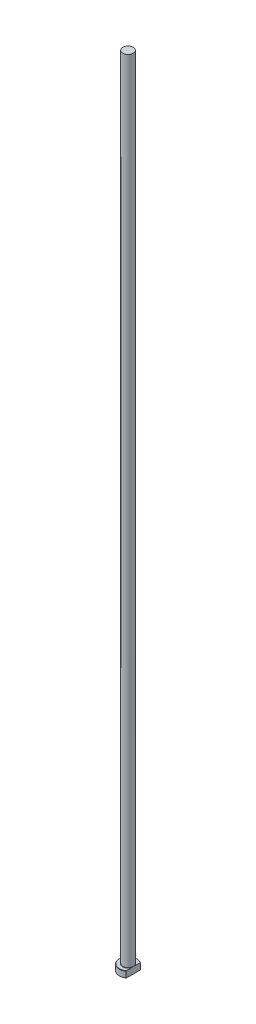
ISO-10303-21;
HEADER;
FILE_DESCRIPTION(('STEP AP214'),'2;1');
FILE_NAME('part.step','',(''),(''),'','','');
FILE_SCHEMA(('AUTOMOTIVE_DESIGN { 1 0 10303 214 1 1 1 1 }'));
ENDSEC;
DATA;
#1=APPLICATION_CONTEXT('core data for automotive mechanical design processes');
#2=APPLICATION_PROTOCOL_DEFINITION('international standard','automotive_design',2000,#1);
#3=PRODUCT_CONTEXT('',#1,'mechanical');
#4=PRODUCT('Part','Part','',(#3));
#5=PRODUCT_RELATED_PRODUCT_CATEGORY('part','',(#4));
#6=PRODUCT_DEFINITION_FORMATION('','',#4);
#7=PRODUCT_DEFINITION_CONTEXT('part definition',#1,'design');
#8=PRODUCT_DEFINITION('design','',#6,#7);
#9=PRODUCT_DEFINITION_SHAPE('','',#8);
#10=(LENGTH_UNIT() NAMED_UNIT(*) SI_UNIT(.MILLI.,.METRE.));
#11=(NAMED_UNIT(*) PLANE_ANGLE_UNIT() SI_UNIT($,.RADIAN.));
#12=(NAMED_UNIT(*) SI_UNIT($,.STERADIAN.) SOLID_ANGLE_UNIT());
#13=UNCERTAINTY_MEASURE_WITH_UNIT(LENGTH_MEASURE(1.E-05),#10,'distance_accuracy_value','');
#14=(GEOMETRIC_REPRESENTATION_CONTEXT(3) GLOBAL_UNCERTAINTY_ASSIGNED_CONTEXT((#13)) GLOBAL_UNIT_ASSIGNED_CONTEXT((#10,
#11,#12)) REPRESENTATION_CONTEXT('',''));
#15=CARTESIAN_POINT('',(0.,0.,0.));
#16=DIRECTION('',(0.,0.,1.));
#17=DIRECTION('',(1.,0.,0.));
#18=AXIS2_PLACEMENT_3D('',#15,#16,#17);
#19=CARTESIAN_POINT('',(0.,0.,0.));
#20=DIRECTION('',(0.,-1.,0.));
#21=DIRECTION('',(0.,0.,-1.));
#22=AXIS2_PLACEMENT_3D('',#19,#20,#21);
#23=PLANE('',#22);
#24=CARTESIAN_POINT('',(0.,0.,0.));
#25=DIRECTION('',(0.,-1.,0.));
#26=DIRECTION('',(0.,0.,-1.));
#27=AXIS2_PLACEMENT_3D('',#24,#25,#26);
#28=CIRCLE('',#27,6.80000000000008);
#29=CARTESIAN_POINT('',(4.09999999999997,0.,5.42494239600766));
#30=VERTEX_POINT('',#29);
#31=CARTESIAN_POINT('',(4.09999999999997,0.,-5.42494239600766));
#32=VERTEX_POINT('',#31);
#33=EDGE_CURVE('E98',#30,#32,#28,.T.);
#34=ORIENTED_EDGE('',*,*,#33,.T.);
#35=DIRECTION('',(0.,0.,1.));
#36=VECTOR('',#35,1.);
#37=CARTESIAN_POINT('',(4.09999999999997,0.,-5.6736231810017));
#38=LINE('',#37,#36);
#39=EDGE_CURVE('E83',#32,#30,#38,.T.);
#40=ORIENTED_EDGE('',*,*,#39,.T.);
#41=EDGE_LOOP('',(#34,#40));
#42=FACE_BOUND('',#41,.T.);
#43=ADVANCED_FACE('F32',(#42),#23,.T.);
#44=CARTESIAN_POINT('',(0.,259.958771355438,0.));
#45=DIRECTION('',(0.,1.,0.));
#46=DIRECTION('',(0.,0.,1.));
#47=AXIS2_PLACEMENT_3D('',#44,#45,#46);
#48=CYLINDRICAL_SURFACE('',#47,6.99999999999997);
#49=CARTESIAN_POINT('',(0.,4.79999999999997,0.));
#50=DIRECTION('',(0.,1.,0.));
#51=DIRECTION('',(0.,0.,1.));
#52=AXIS2_PLACEMENT_3D('',#49,#50,#51);
#53=CIRCLE('',#52,6.99999999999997);
#54=CARTESIAN_POINT('',(4.09999999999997,4.79999999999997,5.6736231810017));
#55=VERTEX_POINT('',#54);
#56=CARTESIAN_POINT('',(4.09999999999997,4.79999999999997,-5.6736231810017));
#57=VERTEX_POINT('',#56);
#58=EDGE_CURVE('E104',#55,#57,#53,.F.);
#59=ORIENTED_EDGE('',*,*,#58,.T.);
#60=DIRECTION('',(0.,-1.,0.));
#61=VECTOR('',#60,1.);
#62=CARTESIAN_POINT('',(4.09999999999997,630.,-5.6736231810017));
#63=LINE('',#62,#61);
#64=CARTESIAN_POINT('',(4.09999999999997,0.199999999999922,-5.6736231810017));
#65=VERTEX_POINT('',#64);
#66=EDGE_CURVE('E183',#57,#65,#63,.T.);
#67=ORIENTED_EDGE('',*,*,#66,.T.);
#68=CARTESIAN_POINT('',(0.,0.199999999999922,0.));
#69=DIRECTION('',(0.,-1.,0.));
#70=DIRECTION('',(0.,0.,-1.));
#71=AXIS2_PLACEMENT_3D('',#68,#69,#70);
#72=CIRCLE('',#71,6.99999999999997);
#73=CARTESIAN_POINT('',(4.09999999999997,0.199999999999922,5.6736231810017));
#74=VERTEX_POINT('',#73);
#75=EDGE_CURVE('E100',#65,#74,#72,.F.);
#76=ORIENTED_EDGE('',*,*,#75,.T.);
#77=DIRECTION('',(0.,-1.,0.));
#78=VECTOR('',#77,1.);
#79=CARTESIAN_POINT('',(4.09999999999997,630.,5.6736231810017));
#80=LINE('',#79,#78);
#81=EDGE_CURVE('E93',#55,#74,#80,.T.);
#82=ORIENTED_EDGE('',*,*,#81,.F.);
#83=EDGE_LOOP('',(#59,#67,#76,#82));
#84=FACE_BOUND('',#83,.T.);
#85=ADVANCED_FACE('F158',(#84),#48,.T.);
#86=CARTESIAN_POINT('',(-6.99999999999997,5.,0.));
#87=DIRECTION('',(0.,1.,0.));
#88=DIRECTION('',(0.,0.,1.));
#89=AXIS2_PLACEMENT_3D('',#86,#87,#88);
#90=PLANE('',#89);
#91=CARTESIAN_POINT('',(0.,5.,0.));
#92=DIRECTION('',(0.,1.,0.));
#93=DIRECTION('',(0.,0.,1.));
#94=AXIS2_PLACEMENT_3D('',#91,#92,#93);
#95=CIRCLE('',#94,6.79999999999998);
#96=CARTESIAN_POINT('',(4.09999999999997,5.,-5.42494239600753));
#97=VERTEX_POINT('',#96);
#98=CARTESIAN_POINT('',(4.09999999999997,5.,5.42494239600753));
#99=VERTEX_POINT('',#98);
#100=EDGE_CURVE('E178',#97,#99,#95,.T.);
#101=ORIENTED_EDGE('',*,*,#100,.T.);
#102=DIRECTION('',(0.,0.,-1.));
#103=VECTOR('',#102,1.);
#104=CARTESIAN_POINT('',(4.09999999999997,5.,0.));
#105=LINE('',#104,#103);
#106=CARTESIAN_POINT('',(4.09999999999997,4.99999999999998,1.29614813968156));
#107=VERTEX_POINT('',#106);
#108=EDGE_CURVE('E57',#99,#107,#105,.T.);
#109=ORIENTED_EDGE('',*,*,#108,.T.);
#110=CARTESIAN_POINT('',(0.,5.,0.));
#111=DIRECTION('',(0.,1.,0.));
#112=DIRECTION('',(0.,0.,1.));
#113=AXIS2_PLACEMENT_3D('',#110,#111,#112);
#114=CIRCLE('',#113,4.29999999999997);
#115=CARTESIAN_POINT('',(4.09999999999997,4.99999999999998,-1.29614813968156));
#116=VERTEX_POINT('',#115);
#117=EDGE_CURVE('E107',#107,#116,#114,.F.);
#118=ORIENTED_EDGE('',*,*,#117,.T.);
#119=EDGE_CURVE('E136',#116,#97,#105,.T.);
#120=ORIENTED_EDGE('',*,*,#119,.T.);
#121=EDGE_LOOP('',(#101,#109,#118,#120));
#122=FACE_BOUND('',#121,.T.);
#123=ADVANCED_FACE('F147',(#122),#90,.T.);
#124=CARTESIAN_POINT('',(0.,5.,0.));
#125=DIRECTION('',(0.,-1.,0.));
#126=DIRECTION('',(0.,0.,-1.));
#127=AXIS2_PLACEMENT_3D('',#124,#125,#126);
#128=CONICAL_SURFACE('',#127,6.79999999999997,0.785398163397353);
#129=ORIENTED_EDGE('',*,*,#58,.F.);
#130=CARTESIAN_POINT('',(4.09999999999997,-1.33929192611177,12.483228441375));
#131=CARTESIAN_POINT('',(4.09999999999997,-1.13691180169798,12.2702073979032));
#132=CARTESIAN_POINT('',(4.09999999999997,-0.934791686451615,12.0569390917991));
#133=CARTESIAN_POINT('',(4.09999999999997,-0.531169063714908,11.6298164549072));
#134=CARTESIAN_POINT('',(4.09999999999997,-0.329666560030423,11.4159621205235));
#135=CARTESIAN_POINT('',(4.09999999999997,0.273965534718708,10.7731725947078));
#136=CARTESIAN_POINT('',(4.09999999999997,0.675017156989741,10.3432236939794));
#137=CARTESIAN_POINT('',(4.09999999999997,1.47875431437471,9.47345436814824));
#138=CARTESIAN_POINT('',(4.09999999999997,1.88138218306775,9.03358046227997));
#139=CARTESIAN_POINT('',(4.09999999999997,2.48056970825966,8.36963259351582));
#140=CARTESIAN_POINT('',(4.09999999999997,2.6794685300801,8.147670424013));
#141=CARTESIAN_POINT('',(4.09999999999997,3.07530374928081,7.70200314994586));
#142=CARTESIAN_POINT('',(4.09999999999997,3.2722401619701,7.47829805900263));
#143=CARTESIAN_POINT('',(4.09999999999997,3.62803580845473,7.06959504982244));
#144=CARTESIAN_POINT('',(4.09999999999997,3.78730687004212,6.88495594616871));
#145=CARTESIAN_POINT('',(4.09999999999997,4.10378434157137,6.51391771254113));
#146=CARTESIAN_POINT('',(4.09999999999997,4.26099077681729,6.3275186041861));
#147=CARTESIAN_POINT('',(4.09999999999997,4.57299335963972,5.95235210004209));
#148=CARTESIAN_POINT('',(4.09999999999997,4.72778657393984,5.76358225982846));
#149=CARTESIAN_POINT('',(4.09999999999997,5.03405385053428,5.38337519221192));
#150=CARTESIAN_POINT('',(4.09999999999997,5.18552806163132,5.19193808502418));
#151=CARTESIAN_POINT('',(4.09999999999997,5.48381165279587,4.80616050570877));
#152=CARTESIAN_POINT('',(4.09999999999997,5.63063104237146,4.61182780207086));
#153=CARTESIAN_POINT('',(4.09999999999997,5.9185732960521,4.218895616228));
#154=CARTESIAN_POINT('',(4.09999999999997,6.05969490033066,4.02029520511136));
#155=CARTESIAN_POINT('',(4.09999999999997,6.33384612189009,3.61807653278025));
#156=CARTESIAN_POINT('',(4.09999999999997,6.46688994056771,3.41446801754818));
#157=CARTESIAN_POINT('',(4.09999999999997,6.721962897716,3.00051329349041));
#158=CARTESIAN_POINT('',(4.09999999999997,6.84399822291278,2.79017096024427));
#159=CARTESIAN_POINT('',(4.09999999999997,7.04294800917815,2.4161362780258));
#160=CARTESIAN_POINT('',(4.09999999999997,7.12340018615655,2.2543409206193));
#161=CARTESIAN_POINT('',(4.09999999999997,7.2727881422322,1.92538984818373));
#162=CARTESIAN_POINT('',(4.09999999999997,7.34172134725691,1.75823294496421));
#163=CARTESIAN_POINT('',(4.09999999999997,7.46395062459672,1.41984946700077));
#164=CARTESIAN_POINT('',(4.09999999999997,7.51737823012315,1.24867129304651));
#165=CARTESIAN_POINT('',(4.09999999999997,7.60539482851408,0.901532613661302));
#166=CARTESIAN_POINT('',(4.09999999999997,7.63999996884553,0.725576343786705));
#167=CARTESIAN_POINT('',(4.09999999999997,7.6803635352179,0.42108610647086));
#168=CARTESIAN_POINT('',(4.09999999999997,7.6915205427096,0.293260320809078));
#169=CARTESIAN_POINT('',(4.09999999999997,7.70182627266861,0.0371280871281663));
#170=CARTESIAN_POINT('',(4.09999999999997,7.70097696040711,-0.0911782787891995));
#171=CARTESIAN_POINT('',(4.09999999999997,7.68730446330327,-0.347367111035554));
#172=CARTESIAN_POINT('',(4.09999999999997,7.6744601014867,-0.475248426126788));
#173=CARTESIAN_POINT('',(4.09999999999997,7.63752967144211,-0.729373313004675));
#174=CARTESIAN_POINT('',(4.09999999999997,7.61344101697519,-0.855616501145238));
#175=CARTESIAN_POINT('',(4.09999999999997,7.54404317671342,-1.15392625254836));
#176=CARTESIAN_POINT('',(4.09999999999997,7.49413451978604,-1.32492035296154));
#177=CARTESIAN_POINT('',(4.09999999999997,7.37892989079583,-1.66161692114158));
#178=CARTESIAN_POINT('',(4.09999999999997,7.31362410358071,-1.82731593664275));
#179=CARTESIAN_POINT('',(4.09999999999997,7.17079959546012,-2.15435858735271));
#180=CARTESIAN_POINT('',(4.09999999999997,7.0932172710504,-2.31567410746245));
#181=CARTESIAN_POINT('',(4.09999999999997,6.97004119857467,-2.5540384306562));
#182=CARTESIAN_POINT('',(4.09999999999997,6.92785402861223,-2.63288278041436));
#183=CARTESIAN_POINT('',(4.09999999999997,6.84148468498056,-2.78946923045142));
#184=CARTESIAN_POINT('',(4.09999999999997,6.79730258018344,-2.86721136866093));
#185=CARTESIAN_POINT('',(4.09999999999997,6.65934609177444,-3.10372248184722));
#186=CARTESIAN_POINT('',(4.09999999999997,6.56274427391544,-3.26084376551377));
#187=CARTESIAN_POINT('',(4.09999999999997,6.3638913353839,-3.5714843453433));
#188=CARTESIAN_POINT('',(4.09999999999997,6.26163896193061,-3.72500283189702));
#189=CARTESIAN_POINT('',(4.09999999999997,6.05267831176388,-4.02913378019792));
#190=CARTESIAN_POINT('',(4.09999999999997,5.94596678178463,-4.17974399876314));
#191=CARTESIAN_POINT('',(4.09999999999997,5.72908222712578,-4.47845767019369));
#192=CARTESIAN_POINT('',(4.09999999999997,5.61890895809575,-4.6265609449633));
#193=CARTESIAN_POINT('',(4.09999999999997,5.39553225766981,-4.92101937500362));
#194=CARTESIAN_POINT('',(4.09999999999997,5.28232219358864,-5.0673694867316));
#195=CARTESIAN_POINT('',(4.09999999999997,5.05364560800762,-5.35829836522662));
#196=CARTESIAN_POINT('',(4.09999999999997,4.93817902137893,-5.50287708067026));
#197=CARTESIAN_POINT('',(4.09999999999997,4.589004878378,-5.93440610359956));
#198=CARTESIAN_POINT('',(4.09999999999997,4.35254037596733,-6.21912657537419));
#199=CARTESIAN_POINT('',(4.09999999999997,3.99368021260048,-6.64336157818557));
#200=CARTESIAN_POINT('',(4.09999999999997,3.87318866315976,-6.78450136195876));
#201=CARTESIAN_POINT('',(4.09999999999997,3.63111125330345,-7.06582575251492));
#202=CARTESIAN_POINT('',(4.09999999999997,3.50952546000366,-7.2060104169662));
#203=CARTESIAN_POINT('',(4.09999999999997,3.14334067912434,-7.6253764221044));
#204=CARTESIAN_POINT('',(4.09999999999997,2.89734299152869,-7.90333600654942));
#205=CARTESIAN_POINT('',(4.09999999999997,2.40293836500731,-8.45636150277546));
#206=CARTESIAN_POINT('',(4.09999999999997,2.15453550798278,-8.73143107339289));
#207=CARTESIAN_POINT('',(4.09999999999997,1.65560568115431,-9.27963529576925));
#208=CARTESIAN_POINT('',(4.09999999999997,1.40507871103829,-9.55276994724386));
#209=CARTESIAN_POINT('',(4.09999999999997,0.947239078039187,-10.0488717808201));
#210=CARTESIAN_POINT('',(4.09999999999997,0.740197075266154,-10.2720890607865));
#211=CARTESIAN_POINT('',(4.09999999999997,0.32511671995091,-10.7177199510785));
#212=CARTESIAN_POINT('',(4.09999999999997,0.117078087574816,-10.9401333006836));
#213=CARTESIAN_POINT('',(4.09999999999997,-0.298674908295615,-11.383046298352));
#214=CARTESIAN_POINT('',(4.09999999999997,-0.506385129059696,-11.6035498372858));
#215=CARTESIAN_POINT('',(4.09999999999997,-0.922403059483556,-12.0438652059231));
#216=CARTESIAN_POINT('',(4.09999999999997,-1.13071056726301,-12.2636772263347));
#217=CARTESIAN_POINT('',(4.09999999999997,-1.33929192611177,-12.483228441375));
#218=B_SPLINE_CURVE_WITH_KNOTS('',3,(#130,#131,#132,#133,#134,#135,#136,#137,#138,#139,#140,
#141,#142,#143,#144,#145,#146,#147,#148,#149,#150,#151,#152,#153,#154,#155,#156,#157,#158,#159,
#160,#161,#162,#163,#164,#165,#166,#167,#168,#169,#170,#171,#172,#173,#174,#175,#176,#177,#178,
#179,#180,#181,#182,#183,#184,#185,#186,#187,#188,#189,#190,#191,#192,#193,#194,#195,#196,#197,
#198,#199,#200,#201,#202,#203,#204,#205,#206,#207,#208,#209,#210,#211,#212,#213,#214,#215,#216,
#217),.UNSPECIFIED.,.F.,.F.,(4,2,2,2,2,2,2,2,2,2,2,2,2,2,2,2,2,2,2,2,2,2,2,2,2,2,2,2,2,2,2,2,2,
2,2,2,2,2,2,2,2,2,2,4),(0.,0.88148793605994,1.76298129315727,3.52684938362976,5.31576438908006,
6.20987642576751,7.10398148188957,7.83549529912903,8.56700014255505,9.29933394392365,
10.0316348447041,10.7622363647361,11.4929985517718,12.2224363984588,12.9514617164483,
13.4932089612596,14.035077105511,14.5722044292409,15.10887023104,15.4932846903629,
15.8776362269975,16.2626676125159,16.6477876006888,17.181194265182,17.7149418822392,
18.2515512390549,18.5197937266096,18.7880269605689,19.3411787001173,19.8944535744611,
20.4481394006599,21.0018643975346,21.5569172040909,22.1119860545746,23.2222096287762,
23.7789368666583,24.3356301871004,25.4491497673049,26.5610293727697,27.6729091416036,
28.5862688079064,29.4999020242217,30.4086844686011,31.3171893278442),.UNSPECIFIED.);
#219=EDGE_CURVE('E135',#55,#99,#218,.T.);
#220=ORIENTED_EDGE('',*,*,#219,.T.);
#221=ORIENTED_EDGE('',*,*,#100,.F.);
#222=EDGE_CURVE('E127',#97,#57,#218,.T.);
#223=ORIENTED_EDGE('',*,*,#222,.T.);
#224=EDGE_LOOP('',(#129,#220,#221,#223));
#225=FACE_BOUND('',#224,.T.);
#226=ADVANCED_FACE('F143',(#225),#128,.T.);
#227=CARTESIAN_POINT('',(0.,0.199999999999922,0.));
#228=DIRECTION('',(0.,1.,0.));
#229=DIRECTION('',(0.,0.,1.));
#230=AXIS2_PLACEMENT_3D('',#227,#228,#229);
#231=CONICAL_SURFACE('',#230,6.99999999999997,0.785398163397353);
#232=ORIENTED_EDGE('',*,*,#75,.F.);
#233=CARTESIAN_POINT('',(4.09999999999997,6.33929192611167,-12.483228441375));
#234=CARTESIAN_POINT('',(4.09999999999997,6.13691180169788,-12.2702073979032));
#235=CARTESIAN_POINT('',(4.09999999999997,5.93479168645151,-12.0569390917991));
#236=CARTESIAN_POINT('',(4.09999999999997,5.5311690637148,-11.6298164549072));
#237=CARTESIAN_POINT('',(4.09999999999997,5.32966656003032,-11.4159621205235));
#238=CARTESIAN_POINT('',(4.09999999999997,4.72603446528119,-10.7731725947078));
#239=CARTESIAN_POINT('',(4.09999999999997,4.32498284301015,-10.3432236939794));
#240=CARTESIAN_POINT('',(4.09999999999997,3.52124568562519,-9.47345436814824));
#241=CARTESIAN_POINT('',(4.09999999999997,3.11861781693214,-9.03358046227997));
#242=CARTESIAN_POINT('',(4.09999999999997,2.51943029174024,-8.36963259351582));
#243=CARTESIAN_POINT('',(4.09999999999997,2.32053146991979,-8.147670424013));
#244=CARTESIAN_POINT('',(4.09999999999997,1.92469625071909,-7.70200314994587));
#245=CARTESIAN_POINT('',(4.09999999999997,1.72775983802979,-7.47829805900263));
#246=CARTESIAN_POINT('',(4.09999999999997,1.37196419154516,-7.06959504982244));
#247=CARTESIAN_POINT('',(4.09999999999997,1.21269312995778,-6.88495594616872));
#248=CARTESIAN_POINT('',(4.09999999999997,0.896215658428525,-6.51391771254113));
#249=CARTESIAN_POINT('',(4.09999999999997,0.739009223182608,-6.3275186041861));
#250=CARTESIAN_POINT('',(4.09999999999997,0.427006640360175,-5.9523521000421));
#251=CARTESIAN_POINT('',(4.09999999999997,0.272213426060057,-5.76358225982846));
#252=CARTESIAN_POINT('',(4.09999999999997,-0.0340538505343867,-5.38337519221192));
#253=CARTESIAN_POINT('',(4.09999999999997,-0.185528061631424,-5.19193808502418));
#254=CARTESIAN_POINT('',(4.09999999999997,-0.483811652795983,-4.80616050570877));
#255=CARTESIAN_POINT('',(4.09999999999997,-0.630631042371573,-4.61182780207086));
#256=CARTESIAN_POINT('',(4.09999999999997,-0.918573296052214,-4.218895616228));
#257=CARTESIAN_POINT('',(4.09999999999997,-1.05969490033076,-4.02029520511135));
#258=CARTESIAN_POINT('',(4.09999999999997,-1.3338461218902,-3.61807653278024));
#259=CARTESIAN_POINT('',(4.09999999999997,-1.46688994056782,-3.41446801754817));
#260=CARTESIAN_POINT('',(4.09999999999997,-1.72196289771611,-3.0005132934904));
#261=CARTESIAN_POINT('',(4.09999999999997,-1.84399822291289,-2.79017096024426));
#262=CARTESIAN_POINT('',(4.09999999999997,-2.04294800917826,-2.4161362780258));
#263=CARTESIAN_POINT('',(4.09999999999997,-2.12340018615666,-2.25434092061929));
#264=CARTESIAN_POINT('',(4.09999999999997,-2.2727881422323,-1.92538984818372));
#265=CARTESIAN_POINT('',(4.09999999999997,-2.34172134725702,-1.75823294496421));
#266=CARTESIAN_POINT('',(4.09999999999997,-2.46395062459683,-1.41984946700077));
#267=CARTESIAN_POINT('',(4.09999999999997,-2.51737823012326,-1.2486712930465));
#268=CARTESIAN_POINT('',(4.09999999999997,-2.60539482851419,-0.901532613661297));
#269=CARTESIAN_POINT('',(4.09999999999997,-2.63999996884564,-0.725576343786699));
#270=CARTESIAN_POINT('',(4.09999999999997,-2.68036353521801,-0.421086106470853));
#271=CARTESIAN_POINT('',(4.09999999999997,-2.6915205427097,-0.293260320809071));
#272=CARTESIAN_POINT('',(4.09999999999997,-2.70182627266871,-0.0371280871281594));
#273=CARTESIAN_POINT('',(4.09999999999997,-2.70097696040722,0.0911782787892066));
#274=CARTESIAN_POINT('',(4.09999999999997,-2.68730446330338,0.347367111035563));
#275=CARTESIAN_POINT('',(4.09999999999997,-2.67446010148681,0.475248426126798));
#276=CARTESIAN_POINT('',(4.09999999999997,-2.63752967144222,0.729373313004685));
#277=CARTESIAN_POINT('',(4.09999999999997,-2.6134410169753,0.855616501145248));
#278=CARTESIAN_POINT('',(4.09999999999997,-2.54404317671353,1.15392625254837));
#279=CARTESIAN_POINT('',(4.09999999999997,-2.49413451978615,1.32492035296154));
#280=CARTESIAN_POINT('',(4.09999999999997,-2.37892989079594,1.66161692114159));
#281=CARTESIAN_POINT('',(4.09999999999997,-2.31362410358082,1.82731593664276));
#282=CARTESIAN_POINT('',(4.09999999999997,-2.17079959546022,2.15435858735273));
#283=CARTESIAN_POINT('',(4.09999999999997,-2.0932172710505,2.31567410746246));
#284=CARTESIAN_POINT('',(4.09999999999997,-1.97004119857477,2.55403843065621));
#285=CARTESIAN_POINT('',(4.09999999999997,-1.92785402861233,2.63288278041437));
#286=CARTESIAN_POINT('',(4.09999999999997,-1.84148468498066,2.78946923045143));
#287=CARTESIAN_POINT('',(4.09999999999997,-1.79730258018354,2.86721136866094));
#288=CARTESIAN_POINT('',(4.09999999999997,-1.65934609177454,3.10372248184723));
#289=CARTESIAN_POINT('',(4.09999999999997,-1.56274427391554,3.26084376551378));
#290=CARTESIAN_POINT('',(4.09999999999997,-1.36389133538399,3.57148434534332));
#291=CARTESIAN_POINT('',(4.09999999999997,-1.26163896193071,3.72500283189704));
#292=CARTESIAN_POINT('',(4.09999999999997,-1.05267831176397,4.02913378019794));
#293=CARTESIAN_POINT('',(4.09999999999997,-0.945966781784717,4.17974399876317));
#294=CARTESIAN_POINT('',(4.09999999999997,-0.729082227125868,4.47845767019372));
#295=CARTESIAN_POINT('',(4.09999999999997,-0.618908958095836,4.62656094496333));
#296=CARTESIAN_POINT('',(4.09999999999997,-0.395532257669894,4.92101937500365));
#297=CARTESIAN_POINT('',(4.09999999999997,-0.282322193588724,5.06736948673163));
#298=CARTESIAN_POINT('',(4.09999999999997,-0.0536456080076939,5.35829836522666));
#299=CARTESIAN_POINT('',(4.09999999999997,0.0618209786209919,5.5028770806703));
#300=CARTESIAN_POINT('',(4.09999999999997,0.410995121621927,5.9344061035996));
#301=CARTESIAN_POINT('',(4.09999999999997,0.647459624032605,6.21912657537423));
#302=CARTESIAN_POINT('',(4.09999999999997,1.00631978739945,6.64336157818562));
#303=CARTESIAN_POINT('',(4.09999999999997,1.12681133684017,6.7845013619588));
#304=CARTESIAN_POINT('',(4.09999999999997,1.36888874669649,7.06582575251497));
#305=CARTESIAN_POINT('',(4.09999999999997,1.49047453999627,7.20601041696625));
#306=CARTESIAN_POINT('',(4.09999999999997,1.8566593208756,7.62537642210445));
#307=CARTESIAN_POINT('',(4.09999999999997,2.10265700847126,7.90333600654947));
#308=CARTESIAN_POINT('',(4.09999999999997,2.59706163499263,8.45636150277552));
#309=CARTESIAN_POINT('',(4.09999999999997,2.84546449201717,8.73143107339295));
#310=CARTESIAN_POINT('',(4.09999999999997,3.34439431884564,9.27963529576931));
#311=CARTESIAN_POINT('',(4.09999999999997,3.59492128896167,9.55276994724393));
#312=CARTESIAN_POINT('',(4.09999999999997,4.05276092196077,10.0488717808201));
#313=CARTESIAN_POINT('',(4.09999999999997,4.25980292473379,10.2720890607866));
#314=CARTESIAN_POINT('',(4.09999999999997,4.67488328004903,10.7177199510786));
#315=CARTESIAN_POINT('',(4.09999999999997,4.88292191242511,10.9401333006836));
#316=CARTESIAN_POINT('',(4.09999999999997,5.29867490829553,11.383046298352));
#317=CARTESIAN_POINT('',(4.09999999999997,5.50638512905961,11.6035498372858));
#318=CARTESIAN_POINT('',(4.09999999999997,5.92240305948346,12.0438652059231));
#319=CARTESIAN_POINT('',(4.09999999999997,6.13071056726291,12.2636772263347));
#320=CARTESIAN_POINT('',(4.09999999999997,6.33929192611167,12.483228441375));
#321=B_SPLINE_CURVE_WITH_KNOTS('',3,(#233,#234,#235,#236,#237,#238,#239,#240,#241,#242,#243,
#244,#245,#246,#247,#248,#249,#250,#251,#252,#253,#254,#255,#256,#257,#258,#259,#260,#261,#262,
#263,#264,#265,#266,#267,#268,#269,#270,#271,#272,#273,#274,#275,#276,#277,#278,#279,#280,#281,
#282,#283,#284,#285,#286,#287,#288,#289,#290,#291,#292,#293,#294,#295,#296,#297,#298,#299,#300,
#301,#302,#303,#304,#305,#306,#307,#308,#309,#310,#311,#312,#313,#314,#315,#316,#317,#318,#319,
#320),.UNSPECIFIED.,.F.,.F.,(4,2,2,2,2,2,2,2,2,2,2,2,2,2,2,2,2,2,2,2,2,2,2,2,2,2,2,2,2,2,2,2,2,
2,2,2,2,2,2,2,2,2,2,4),(0.,0.881487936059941,1.76298129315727,3.52684938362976,5.31576438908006,
6.20987642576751,7.10398148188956,7.83549529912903,8.56700014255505,9.29933394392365,
10.0316348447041,10.7622363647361,11.4929985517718,12.2224363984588,12.9514617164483,
13.4932089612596,14.035077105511,14.572204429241,15.10887023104,15.4932846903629,
15.8776362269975,16.2626676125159,16.6477876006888,17.181194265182,17.7149418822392,
18.2515512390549,18.5197937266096,18.7880269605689,19.3411787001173,19.8944535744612,
20.4481394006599,21.0018643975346,21.556917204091,22.1119860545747,23.2222096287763,
23.7789368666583,24.3356301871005,25.449149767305,26.5610293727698,27.6729091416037,
28.5862688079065,29.4999020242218,30.4086844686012,31.3171893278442),.UNSPECIFIED.);
#322=EDGE_CURVE('E86',#65,#32,#321,.T.);
#323=ORIENTED_EDGE('',*,*,#322,.T.);
#324=ORIENTED_EDGE('',*,*,#33,.F.);
#325=EDGE_CURVE('E89',#30,#74,#321,.T.);
#326=ORIENTED_EDGE('',*,*,#325,.T.);
#327=EDGE_LOOP('',(#232,#323,#324,#326));
#328=FACE_BOUND('',#327,.T.);
#329=ADVANCED_FACE('F97',(#328),#231,.T.);
#330=CARTESIAN_POINT('',(0.,5.19999999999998,0.));
#331=DIRECTION('',(0.,1.,0.));
#332=DIRECTION('',(0.,0.,1.));
#333=AXIS2_PLACEMENT_3D('',#330,#331,#332);
#334=TOROIDAL_SURFACE('',#333,4.29999999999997,0.2);
#335=CARTESIAN_POINT('',(4.09999999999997,5.19999999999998,0.));
#336=CARTESIAN_POINT('',(4.09999999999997,5.20000051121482,8.48177579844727E-11));
#337=CARTESIAN_POINT('',(4.09999999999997,5.2000010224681,-2.37341874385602E-07));
#338=CARTESIAN_POINT('',(4.09999999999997,5.20000197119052,-8.69991321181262E-07));
#339=CARTESIAN_POINT('',(4.09999999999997,5.20000238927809,-1.28223494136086E-06));
#340=CARTESIAN_POINT('',(4.09999999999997,5.20000327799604,-2.27653388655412E-06));
#341=CARTESIAN_POINT('',(4.09999999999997,5.20000373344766,-2.87471299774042E-06));
#342=CARTESIAN_POINT('',(4.09999999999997,5.20000453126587,-4.09830357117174E-06));
#343=CARTESIAN_POINT('',(4.09999999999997,5.20000487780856,-4.72126748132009E-06));
#344=CARTESIAN_POINT('',(4.09999999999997,5.20000620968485,-7.19543436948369E-06));
#345=CARTESIAN_POINT('',(4.09999999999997,5.20000713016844,-9.08507628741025E-06));
#346=CARTESIAN_POINT('',(4.09999999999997,5.20000860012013,-1.27786167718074E-05));
#347=CARTESIAN_POINT('',(4.09999999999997,5.2000091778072,-1.45716794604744E-05));
#348=CARTESIAN_POINT('',(4.09999999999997,5.20001167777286,-2.23278313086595E-05));
#349=CARTESIAN_POINT('',(4.09999999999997,5.20001360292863,-2.82919348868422E-05));
#350=CARTESIAN_POINT('',(4.09999999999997,5.20001636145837,-3.94393207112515E-05));
#351=CARTESIAN_POINT('',(4.09999999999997,5.20001732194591,-4.459065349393E-05));
#352=CARTESIAN_POINT('',(4.09999999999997,5.20002443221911,-8.33481274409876E-05));
#353=CARTESIAN_POINT('',(4.09999999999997,5.20002995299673,-0.000117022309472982));
#354=CARTESIAN_POINT('',(4.09999999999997,5.20005411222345,-0.000250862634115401));
#355=CARTESIAN_POINT('',(4.09999999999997,5.20007702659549,-0.000350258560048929));
#356=CARTESIAN_POINT('',(4.09999999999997,5.20016686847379,-0.000745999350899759));
#357=CARTESIAN_POINT('',(4.09999999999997,5.20023113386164,-0.00104273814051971));
#358=CARTESIAN_POINT('',(4.09999999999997,5.20048975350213,-0.00222871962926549));
#359=CARTESIAN_POINT('',(4.09999999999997,5.20068752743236,-0.00311743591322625));
#360=CARTESIAN_POINT('',(4.09999999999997,5.20151360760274,-0.00683863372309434));
#361=CARTESIAN_POINT('',(4.09999999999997,5.20213761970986,-0.00967177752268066));
#362=CARTESIAN_POINT('',(4.09999999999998,5.21060513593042,-0.0481053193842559));
#363=CARTESIAN_POINT('',(4.09999999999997,5.21847514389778,-0.0837019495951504));
#364=CARTESIAN_POINT('',(4.09999999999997,5.23497753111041,-0.15888321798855));
#365=CARTESIAN_POINT('',(4.09999999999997,5.24359721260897,-0.198470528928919));
#366=CARTESIAN_POINT('',(4.09999999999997,5.25810552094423,-0.266014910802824));
#367=CARTESIAN_POINT('',(4.09999999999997,5.26405008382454,-0.293959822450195));
#368=CARTESIAN_POINT('',(4.09999999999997,5.27562355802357,-0.34912552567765));
#369=CARTESIAN_POINT('',(4.09999999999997,5.28125665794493,-0.376345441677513));
#370=CARTESIAN_POINT('',(4.09999999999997,5.29943979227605,-0.46575599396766));
#371=CARTESIAN_POINT('',(4.09999999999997,5.31159607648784,-0.528028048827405));
#372=CARTESIAN_POINT('',(4.09999999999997,5.3345183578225,-0.653452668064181));
#373=CARTESIAN_POINT('',(4.09999999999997,5.34526982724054,-0.716607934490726));
#374=CARTESIAN_POINT('',(4.09999999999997,5.36549989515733,-0.849208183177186));
#375=CARTESIAN_POINT('',(4.09999999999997,5.37476398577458,-0.918686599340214));
#376=CARTESIAN_POINT('',(4.09999999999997,5.38955225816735,-1.05786044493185));
#377=CARTESIAN_POINT('',(4.09999999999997,5.39508786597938,-1.12755454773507));
#378=CARTESIAN_POINT('',(4.09999999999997,5.3992964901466,-1.23112590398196));
#379=CARTESIAN_POINT('',(4.09999999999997,5.40003705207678,-1.26491756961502));
#380=CARTESIAN_POINT('',(4.09999999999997,5.39995996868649,-1.33249559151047));
#381=CARTESIAN_POINT('',(4.09999999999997,5.39914270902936,-1.36628194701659));
#382=CARTESIAN_POINT('',(4.09999999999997,5.39557880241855,-1.43339843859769));
#383=CARTESIAN_POINT('',(4.09999999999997,5.39285312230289,-1.46672955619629));
#384=CARTESIAN_POINT('',(4.09999999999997,5.3849220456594,-1.53304911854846));
#385=CARTESIAN_POINT('',(4.09999999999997,5.37972044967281,-1.56603800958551));
#386=CARTESIAN_POINT('',(4.09999999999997,5.36576321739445,-1.63210333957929));
#387=CARTESIAN_POINT('',(4.09999999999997,5.35693238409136,-1.66516593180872));
#388=CARTESIAN_POINT('',(4.09999999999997,5.33956496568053,-1.71313701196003));
#389=CARTESIAN_POINT('',(4.09999999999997,5.33312382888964,-1.72879572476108));
#390=CARTESIAN_POINT('',(4.09999999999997,5.31841020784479,-1.75921181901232));
#391=CARTESIAN_POINT('',(4.09999999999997,5.31014484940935,-1.77397243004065));
#392=CARTESIAN_POINT('',(4.09999999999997,5.29597609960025,-1.79459137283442));
#393=CARTESIAN_POINT('',(4.09999999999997,5.29105059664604,-1.80111732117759));
#394=CARTESIAN_POINT('',(4.09999999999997,5.28047159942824,-1.81356806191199));
#395=CARTESIAN_POINT('',(4.09999999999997,5.27481806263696,-1.81949281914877));
#396=CARTESIAN_POINT('',(4.09999999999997,5.26378662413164,-1.82942177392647));
#397=CARTESIAN_POINT('',(4.09999999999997,5.25854825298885,-1.83357893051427));
#398=CARTESIAN_POINT('',(4.09999999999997,5.24747881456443,-1.8410175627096));
#399=CARTESIAN_POINT('',(4.09999999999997,5.24164898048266,-1.84430081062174));
#400=CARTESIAN_POINT('',(4.09999999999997,5.23103019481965,-1.84897077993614));
#401=CARTESIAN_POINT('',(4.09999999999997,5.22636142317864,-1.85062832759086));
#402=CARTESIAN_POINT('',(4.09999999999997,5.21681344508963,-1.85314556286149));
#403=CARTESIAN_POINT('',(4.09999999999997,5.21193447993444,-1.85400614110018));
#404=CARTESIAN_POINT('',(4.09999999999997,5.2020790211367,-1.8548454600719));
#405=CARTESIAN_POINT('',(4.09999999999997,5.19710220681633,-1.85482052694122));
#406=CARTESIAN_POINT('',(4.09999999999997,5.18723254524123,-1.85388227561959));
#407=CARTESIAN_POINT('',(4.09999999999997,5.18233974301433,-1.8529684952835));
#408=CARTESIAN_POINT('',(4.09999999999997,5.17301169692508,-1.85041011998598));
#409=CARTESIAN_POINT('',(4.09999999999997,5.16856577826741,-1.84880345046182));
#410=CARTESIAN_POINT('',(4.09999999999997,5.15994310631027,-1.84499014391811));
#411=CARTESIAN_POINT('',(4.09999999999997,5.15576643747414,-1.84278331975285));
#412=CARTESIAN_POINT('',(4.09999999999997,5.1448604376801,-1.83616140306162));
#413=CARTESIAN_POINT('',(4.09999999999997,5.13841060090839,-1.8312871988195));
#414=CARTESIAN_POINT('',(4.09999999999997,5.12632402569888,-1.82061430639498));
#415=CARTESIAN_POINT('',(4.09999999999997,5.12069027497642,-1.81481237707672));
#416=CARTESIAN_POINT('',(4.09999999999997,5.10569835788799,-1.79748307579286));
#417=CARTESIAN_POINT('',(4.09999999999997,5.0971810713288,-1.78523612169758));
#418=CARTESIAN_POINT('',(4.09999999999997,5.08190874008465,-1.759730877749));
#419=CARTESIAN_POINT('',(4.09999999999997,5.07515617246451,-1.74647119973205));
#420=CARTESIAN_POINT('',(4.09999999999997,5.06057670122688,-1.71404296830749));
#421=CARTESIAN_POINT('',(4.09999999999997,5.05336936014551,-1.69459894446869));
#422=CARTESIAN_POINT('',(4.09999999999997,5.04078670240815,-1.65511361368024));
#423=CARTESIAN_POINT('',(4.09999999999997,5.03541518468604,-1.63507116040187));
#424=CARTESIAN_POINT('',(4.09999999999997,5.02602669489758,-1.59438056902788));
#425=CARTESIAN_POINT('',(4.09999999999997,5.02202979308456,-1.57372787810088));
#426=CARTESIAN_POINT('',(4.09999999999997,5.01520764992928,-1.53226128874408));
#427=CARTESIAN_POINT('',(4.09999999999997,5.01238102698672,-1.51144761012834));
#428=CARTESIAN_POINT('',(4.09999999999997,5.00618826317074,-1.45642510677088));
#429=CARTESIAN_POINT('',(4.09999999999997,5.00362476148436,-1.42212636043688));
#430=CARTESIAN_POINT('',(4.09999999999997,5.00045800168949,-1.35343324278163));
#431=CARTESIAN_POINT('',(4.09999999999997,4.99985588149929,-1.31903882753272));
#432=CARTESIAN_POINT('',(4.09999999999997,5.00037893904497,-1.21560964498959));
#433=CARTESIAN_POINT('',(4.09999999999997,5.00385566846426,-1.14658832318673));
#434=CARTESIAN_POINT('',(4.09999999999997,5.01464295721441,-1.01357004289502));
#435=CARTESIAN_POINT('',(4.09999999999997,5.02167983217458,-0.949547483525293));
#436=CARTESIAN_POINT('',(4.09999999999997,5.03833051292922,-0.822416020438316));
#437=CARTESIAN_POINT('',(4.09999999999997,5.04792112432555,-0.759304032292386));
#438=CARTESIAN_POINT('',(4.09999999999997,5.06649836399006,-0.648156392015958));
#439=CARTESIAN_POINT('',(4.09999999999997,5.07509963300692,-0.60005440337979));
#440=CARTESIAN_POINT('',(4.09999999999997,5.09336865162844,-0.5027171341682));
#441=CARTESIAN_POINT('',(4.09999999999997,5.10305882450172,-0.45348607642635));
#442=CARTESIAN_POINT('',(4.09999999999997,5.12010265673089,-0.369650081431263));
#443=CARTESIAN_POINT('',(4.09999999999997,5.1273025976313,-0.335013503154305));
#444=CARTESIAN_POINT('',(4.09999999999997,5.14184386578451,-0.26617579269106));
#445=CARTESIAN_POINT('',(4.09999999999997,5.14918270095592,-0.231974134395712));
#446=CARTESIAN_POINT('',(4.09999999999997,5.16314314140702,-0.167541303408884));
#447=CARTESIAN_POINT('',(4.09999999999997,5.16974991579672,-0.137306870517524));
#448=CARTESIAN_POINT('',(4.09999999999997,5.18332308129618,-0.0755506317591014));
#449=CARTESIAN_POINT('',(4.09999999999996,5.19029270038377,-0.0440294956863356));
#450=CARTESIAN_POINT('',(4.09999999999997,5.19786353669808,-0.00966658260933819));
#451=CARTESIAN_POINT('',(4.09999999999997,5.19848867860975,-0.00682823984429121));
#452=CARTESIAN_POINT('',(4.09999999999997,5.19931502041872,-0.00310588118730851));
#453=CARTESIAN_POINT('',(4.09999999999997,5.19951189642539,-0.00222119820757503));
#454=CARTESIAN_POINT('',(4.09999999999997,5.19976942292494,-0.00104022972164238));
#455=CARTESIAN_POINT('',(4.09999999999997,5.19983347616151,-0.000744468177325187));
#456=CARTESIAN_POINT('',(4.09999999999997,5.19992306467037,-0.000349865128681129));
#457=CARTESIAN_POINT('',(4.09999999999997,5.1999459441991,-0.000250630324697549));
#458=CARTESIAN_POINT('',(4.09999999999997,5.19997007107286,-0.000116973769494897));
#459=CARTESIAN_POINT('',(4.09999999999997,5.19997558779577,-8.33211280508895E-05));
#460=CARTESIAN_POINT('',(4.09999999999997,5.19998268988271,-4.45857715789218E-05));
#461=CARTESIAN_POINT('',(4.09999999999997,5.19998364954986,-3.94355404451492E-05));
#462=CARTESIAN_POINT('',(4.09999999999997,5.19998640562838,-2.82904942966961E-05));
#463=CARTESIAN_POINT('',(4.09999999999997,5.19998832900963,-2.23275713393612E-05));
#464=CARTESIAN_POINT('',(4.09999999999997,5.19999082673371,-1.45726655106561E-05));
#465=CARTESIAN_POINT('',(4.09999999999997,5.19999140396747,-1.27796833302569E-05));
#466=CARTESIAN_POINT('',(4.09999999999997,5.19999287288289,-9.08623741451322E-06));
#467=CARTESIAN_POINT('',(4.09999999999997,5.19999379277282,-7.19659802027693E-06));
#468=CARTESIAN_POINT('',(4.09999999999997,5.19999512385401,-4.72235852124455E-06));
#469=CARTESIAN_POINT('',(4.09999999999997,5.1999954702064,-4.0993503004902E-06));
#470=CARTESIAN_POINT('',(4.09999999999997,5.19999626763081,-2.87563677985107E-06));
#471=CARTESIAN_POINT('',(4.09999999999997,5.19999672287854,-2.2773772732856E-06));
#472=CARTESIAN_POINT('',(4.09999999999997,5.19999761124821,-1.28289389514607E-06));
#473=CARTESIAN_POINT('',(4.09999999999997,5.19999802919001,-8.70554048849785E-07));
#474=CARTESIAN_POINT('',(4.09999999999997,5.19999897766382,-2.3765555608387E-07));
#475=CARTESIAN_POINT('',(4.09999999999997,5.19999948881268,-8.48131903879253E-11));
#476=CARTESIAN_POINT('',(4.09999999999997,5.19999999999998,0.));
#477=B_SPLINE_CURVE_WITH_KNOTS('',3,(#335,#336,#337,#338,#339,#340,#341,#342,#343,#344,#345,
#346,#347,#348,#349,#350,#351,#352,#353,#354,#355,#356,#357,#358,#359,#360,#361,#362,#363,#364,
#365,#366,#367,#368,#369,#370,#371,#372,#373,#374,#375,#376,#377,#378,#379,#380,#381,#382,#383,
#384,#385,#386,#387,#388,#389,#390,#391,#392,#393,#394,#395,#396,#397,#398,#399,#400,#401,#402,
#403,#404,#405,#406,#407,#408,#409,#410,#411,#412,#413,#414,#415,#416,#417,#418,#419,#420,#421,
#422,#423,#424,#425,#426,#427,#428,#429,#430,#431,#432,#433,#434,#435,#436,#437,#438,#439,#440,
#441,#442,#443,#444,#445,#446,#447,#448,#449,#450,#451,#452,#453,#454,#455,#456,#457,#458,#459,
#460,#461,#462,#463,#464,#465,#466,#467,#468,#469,#470,#471,#472,#473,#474,#475,#476),
.UNSPECIFIED.,.T.,.F.,(4,2,2,2,2,2,2,2,2,2,2,2,2,2,2,2,2,2,2,2,2,2,2,2,2,2,2,2,2,2,2,2,2,2,2,2,
2,2,2,2,2,2,2,2,2,2,2,2,2,2,2,2,2,2,2,2,2,2,2,2,2,2,2,2,2,2,2,2,2,2,4),(0.,1.56077961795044E-06,
3.3330233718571E-06,5.57220089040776E-06,7.71031786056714E-06,1.39959462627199E-05,
1.96420817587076E-05,3.84177478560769E-05,5.41207073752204E-05,0.000156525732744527,
0.000462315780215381,0.00137340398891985,0.00410448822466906,0.0128079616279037,
0.122174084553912,0.243719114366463,0.329429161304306,0.41281904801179,0.603149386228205,
0.795314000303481,1.0055338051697,1.21510641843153,1.31647802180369,1.41782453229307,
1.51807472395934,1.61817152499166,1.72045618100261,1.77118252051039,1.82171411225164,
1.84620451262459,1.87069634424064,1.89069743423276,1.91065764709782,1.92546132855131,
1.94024844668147,1.9550969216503,1.96995312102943,1.98408278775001,1.99821686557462,
2.02232905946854,2.04652741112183,2.09102796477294,2.13559065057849,2.19765435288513,
2.25984571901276,2.32290998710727,2.38589958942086,2.489000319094,2.59216085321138,
2.79925959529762,2.99242441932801,3.18389136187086,3.33047882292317,3.48099951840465,
3.58712985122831,3.69206963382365,3.78491369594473,3.88175875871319,3.89047819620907,
3.89319688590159,3.89410497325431,3.89441026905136,3.8945126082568,3.89452830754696,
3.8945470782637,3.89455272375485,3.89455900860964,3.89456114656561,3.89456338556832,
3.8945651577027,3.89456671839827),.UNSPECIFIED.);
#478=CARTESIAN_POINT('',(4.09999999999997,5.19999999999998,0.));
#479=VERTEX_POINT('',#478);
#480=EDGE_CURVE('E11',#116,#479,#477,.T.);
#481=ORIENTED_EDGE('',*,*,#480,.F.);
#482=ORIENTED_EDGE('',*,*,#117,.F.);
#483=CARTESIAN_POINT('',(4.09999999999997,5.19999999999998,0.));
#484=CARTESIAN_POINT('',(4.09999999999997,5.19999948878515,-8.48181322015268E-11));
#485=CARTESIAN_POINT('',(4.09999999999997,5.19999897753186,2.37341874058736E-07));
#486=CARTESIAN_POINT('',(4.09999999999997,5.19999802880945,8.69991321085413E-07));
#487=CARTESIAN_POINT('',(4.09999999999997,5.19999761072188,1.28223494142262E-06));
#488=CARTESIAN_POINT('',(4.09999999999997,5.19999672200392,2.27653388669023E-06));
#489=CARTESIAN_POINT('',(4.09999999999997,5.1999962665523,2.874712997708E-06));
#490=CARTESIAN_POINT('',(4.09999999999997,5.19999546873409,4.0983035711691E-06));
#491=CARTESIAN_POINT('',(4.09999999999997,5.1999951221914,4.72126748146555E-06));
#492=CARTESIAN_POINT('',(4.09999999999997,5.19999379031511,7.19543437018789E-06));
#493=CARTESIAN_POINT('',(4.09999999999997,5.19999286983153,9.0850762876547E-06));
#494=CARTESIAN_POINT('',(4.09999999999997,5.19999139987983,1.27786167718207E-05));
#495=CARTESIAN_POINT('',(4.09999999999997,5.19999082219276,1.45716794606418E-05));
#496=CARTESIAN_POINT('',(4.09999999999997,5.1999883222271,2.2327831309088E-05));
#497=CARTESIAN_POINT('',(4.09999999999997,5.19998639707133,2.82919348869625E-05));
#498=CARTESIAN_POINT('',(4.09999999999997,5.19998363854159,3.94393207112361E-05));
#499=CARTESIAN_POINT('',(4.09999999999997,5.19998267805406,4.45906534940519E-05));
#500=CARTESIAN_POINT('',(4.09999999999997,5.19997556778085,8.33481274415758E-05));
#501=CARTESIAN_POINT('',(4.09999999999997,5.19997004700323,0.000117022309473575));
#502=CARTESIAN_POINT('',(4.09999999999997,5.19994588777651,0.000250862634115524));
#503=CARTESIAN_POINT('',(4.09999999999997,5.19992297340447,0.000350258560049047));
#504=CARTESIAN_POINT('',(4.09999999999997,5.19983313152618,0.000745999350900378));
#505=CARTESIAN_POINT('',(4.09999999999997,5.19976886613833,0.00104273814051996));
#506=CARTESIAN_POINT('',(4.09999999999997,5.19951024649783,0.00222871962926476));
#507=CARTESIAN_POINT('',(4.09999999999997,5.1993124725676,0.00311743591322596));
#508=CARTESIAN_POINT('',(4.09999999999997,5.19848639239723,0.00683863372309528));
#509=CARTESIAN_POINT('',(4.09999999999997,5.19786238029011,0.0096717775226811));
#510=CARTESIAN_POINT('',(4.09999999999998,5.18939486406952,0.0481053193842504));
#511=CARTESIAN_POINT('',(4.09999999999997,5.18152485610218,0.0837019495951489));
#512=CARTESIAN_POINT('',(4.09999999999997,5.16502246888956,0.158883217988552));
#513=CARTESIAN_POINT('',(4.09999999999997,5.156402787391,0.19847052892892));
#514=CARTESIAN_POINT('',(4.09999999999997,5.14189447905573,0.266014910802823));
#515=CARTESIAN_POINT('',(4.09999999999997,5.13594991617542,0.293959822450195));
#516=CARTESIAN_POINT('',(4.09999999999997,5.12437644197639,0.34912552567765));
#517=CARTESIAN_POINT('',(4.09999999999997,5.11874334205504,0.376345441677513));
#518=CARTESIAN_POINT('',(4.09999999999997,5.10056020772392,0.46575599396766));
#519=CARTESIAN_POINT('',(4.09999999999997,5.08840392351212,0.528028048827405));
#520=CARTESIAN_POINT('',(4.09999999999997,5.06548164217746,0.65345266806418));
#521=CARTESIAN_POINT('',(4.09999999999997,5.05473017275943,0.716607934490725));
#522=CARTESIAN_POINT('',(4.09999999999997,5.03450010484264,0.849208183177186));
#523=CARTESIAN_POINT('',(4.09999999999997,5.02523601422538,0.918686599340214));
#524=CARTESIAN_POINT('',(4.09999999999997,5.01044774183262,1.05786044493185));
#525=CARTESIAN_POINT('',(4.09999999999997,5.00491213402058,1.12755454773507));
#526=CARTESIAN_POINT('',(4.09999999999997,5.00070350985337,1.23112590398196));
#527=CARTESIAN_POINT('',(4.09999999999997,4.99996294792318,1.26491756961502));
#528=CARTESIAN_POINT('',(4.09999999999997,5.00004003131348,1.33249559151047));
#529=CARTESIAN_POINT('',(4.09999999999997,5.00085729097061,1.36628194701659));
#530=CARTESIAN_POINT('',(4.09999999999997,5.00442119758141,1.43339843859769));
#531=CARTESIAN_POINT('',(4.09999999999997,5.00714687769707,1.46672955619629));
#532=CARTESIAN_POINT('',(4.09999999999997,5.01507795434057,1.53304911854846));
#533=CARTESIAN_POINT('',(4.09999999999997,5.02027955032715,1.56603800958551));
#534=CARTESIAN_POINT('',(4.09999999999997,5.03423678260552,1.63210333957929));
#535=CARTESIAN_POINT('',(4.09999999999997,5.04306761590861,1.66516593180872));
#536=CARTESIAN_POINT('',(4.09999999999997,5.06043503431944,1.71313701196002));
#537=CARTESIAN_POINT('',(4.09999999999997,5.06687617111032,1.72879572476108));
#538=CARTESIAN_POINT('',(4.09999999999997,5.08158979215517,1.75921181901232));
#539=CARTESIAN_POINT('',(4.09999999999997,5.08985515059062,1.77397243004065));
#540=CARTESIAN_POINT('',(4.09999999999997,5.10402390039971,1.79459137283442));
#541=CARTESIAN_POINT('',(4.09999999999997,5.10894940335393,1.8011173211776));
#542=CARTESIAN_POINT('',(4.09999999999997,5.11952840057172,1.81356806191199));
#543=CARTESIAN_POINT('',(4.09999999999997,5.12518193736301,1.81949281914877));
#544=CARTESIAN_POINT('',(4.09999999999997,5.13621337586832,1.82942177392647));
#545=CARTESIAN_POINT('',(4.09999999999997,5.14145174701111,1.83357893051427));
#546=CARTESIAN_POINT('',(4.09999999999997,5.15252118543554,1.8410175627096));
#547=CARTESIAN_POINT('',(4.09999999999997,5.1583510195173,1.84430081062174));
#548=CARTESIAN_POINT('',(4.09999999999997,5.16896980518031,1.84897077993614));
#549=CARTESIAN_POINT('',(4.09999999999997,5.17363857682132,1.85062832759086));
#550=CARTESIAN_POINT('',(4.09999999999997,5.18318655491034,1.85314556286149));
#551=CARTESIAN_POINT('',(4.09999999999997,5.18806552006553,1.85400614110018));
#552=CARTESIAN_POINT('',(4.09999999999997,5.19792097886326,1.8548454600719));
#553=CARTESIAN_POINT('',(4.09999999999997,5.20289779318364,1.85482052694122));
#554=CARTESIAN_POINT('',(4.09999999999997,5.21276745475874,1.85388227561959));
#555=CARTESIAN_POINT('',(4.09999999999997,5.21766025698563,1.8529684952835));
#556=CARTESIAN_POINT('',(4.09999999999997,5.22698830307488,1.85041011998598));
#557=CARTESIAN_POINT('',(4.09999999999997,5.23143422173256,1.84880345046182));
#558=CARTESIAN_POINT('',(4.09999999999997,5.2400568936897,1.84499014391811));
#559=CARTESIAN_POINT('',(4.09999999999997,5.24423356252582,1.84278331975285));
#560=CARTESIAN_POINT('',(4.09999999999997,5.25513956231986,1.83616140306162));
#561=CARTESIAN_POINT('',(4.09999999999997,5.26158939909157,1.8312871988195));
#562=CARTESIAN_POINT('',(4.09999999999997,5.27367597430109,1.82061430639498));
#563=CARTESIAN_POINT('',(4.09999999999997,5.27930972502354,1.81481237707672));
#564=CARTESIAN_POINT('',(4.09999999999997,5.29430164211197,1.79748307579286));
#565=CARTESIAN_POINT('',(4.09999999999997,5.30281892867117,1.78523612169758));
#566=CARTESIAN_POINT('',(4.09999999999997,5.31809125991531,1.759730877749));
#567=CARTESIAN_POINT('',(4.09999999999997,5.32484382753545,1.74647119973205));
#568=CARTESIAN_POINT('',(4.09999999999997,5.33942329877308,1.71404296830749));
#569=CARTESIAN_POINT('',(4.09999999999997,5.34663063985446,1.69459894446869));
#570=CARTESIAN_POINT('',(4.09999999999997,5.35921329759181,1.65511361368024));
#571=CARTESIAN_POINT('',(4.09999999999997,5.36458481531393,1.63507116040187));
#572=CARTESIAN_POINT('',(4.09999999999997,5.37397330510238,1.59438056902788));
#573=CARTESIAN_POINT('',(4.09999999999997,5.3779702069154,1.57372787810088));
#574=CARTESIAN_POINT('',(4.09999999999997,5.38479235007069,1.53226128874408));
#575=CARTESIAN_POINT('',(4.09999999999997,5.38761897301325,1.51144761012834));
#576=CARTESIAN_POINT('',(4.09999999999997,5.39381173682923,1.45642510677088));
#577=CARTESIAN_POINT('',(4.09999999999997,5.3963752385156,1.42212636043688));
#578=CARTESIAN_POINT('',(4.09999999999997,5.39954199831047,1.35343324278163));
#579=CARTESIAN_POINT('',(4.09999999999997,5.40014411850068,1.31903882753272));
#580=CARTESIAN_POINT('',(4.09999999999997,5.39962106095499,1.21560964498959));
#581=CARTESIAN_POINT('',(4.09999999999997,5.3961443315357,1.14658832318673));
#582=CARTESIAN_POINT('',(4.09999999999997,5.38535704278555,1.01357004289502));
#583=CARTESIAN_POINT('',(4.09999999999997,5.37832016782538,0.949547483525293));
#584=CARTESIAN_POINT('',(4.09999999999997,5.36166948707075,0.822416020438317));
#585=CARTESIAN_POINT('',(4.09999999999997,5.35207887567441,0.759304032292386));
#586=CARTESIAN_POINT('',(4.09999999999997,5.33350163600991,0.648156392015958));
#587=CARTESIAN_POINT('',(4.09999999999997,5.32490036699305,0.60005440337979));
#588=CARTESIAN_POINT('',(4.09999999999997,5.30663134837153,0.5027171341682));
#589=CARTESIAN_POINT('',(4.09999999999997,5.29694117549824,0.453486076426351));
#590=CARTESIAN_POINT('',(4.09999999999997,5.27989734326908,0.369650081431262));
#591=CARTESIAN_POINT('',(4.09999999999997,5.27269740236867,0.335013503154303));
#592=CARTESIAN_POINT('',(4.09999999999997,5.25815613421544,0.266175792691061));
#593=CARTESIAN_POINT('',(4.09999999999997,5.25081729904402,0.231974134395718));
#594=CARTESIAN_POINT('',(4.09999999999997,5.23685685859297,0.167541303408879));
#595=CARTESIAN_POINT('',(4.09999999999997,5.23025008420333,0.137306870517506));
#596=CARTESIAN_POINT('',(4.09999999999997,5.21667691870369,0.0755506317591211));
#597=CARTESIAN_POINT('',(4.09999999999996,5.20970729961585,0.0440294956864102));
#598=CARTESIAN_POINT('',(4.09999999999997,5.20213646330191,0.00966658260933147));
#599=CARTESIAN_POINT('',(4.09999999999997,5.20151132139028,0.00682823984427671));
#600=CARTESIAN_POINT('',(4.09999999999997,5.20068497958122,0.00310588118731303));
#601=CARTESIAN_POINT('',(4.09999999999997,5.20048810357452,0.00222119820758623));
#602=CARTESIAN_POINT('',(4.09999999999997,5.20023057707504,0.00104022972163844));
#603=CARTESIAN_POINT('',(4.09999999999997,5.2001665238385,0.000744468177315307));
#604=CARTESIAN_POINT('',(4.09999999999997,5.20007693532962,0.000349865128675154));
#605=CARTESIAN_POINT('',(4.09999999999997,5.20005405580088,0.000250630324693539));
#606=CARTESIAN_POINT('',(4.09999999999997,5.20002992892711,0.000116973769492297));
#607=CARTESIAN_POINT('',(4.09999999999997,5.20002441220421,8.33211280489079E-05));
#608=CARTESIAN_POINT('',(4.09999999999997,5.20001731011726,4.45857715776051E-05));
#609=CARTESIAN_POINT('',(4.09999999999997,5.20001635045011,3.94355404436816E-05));
#610=CARTESIAN_POINT('',(4.09999999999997,5.20001359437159,2.82904942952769E-05));
#611=CARTESIAN_POINT('',(4.09999999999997,5.20001167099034,2.23275713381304E-05));
#612=CARTESIAN_POINT('',(4.09999999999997,5.20000917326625,1.45726655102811E-05));
#613=CARTESIAN_POINT('',(4.09999999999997,5.2000085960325,1.27796833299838E-05));
#614=CARTESIAN_POINT('',(4.09999999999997,5.20000712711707,9.08623741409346E-06));
#615=CARTESIAN_POINT('',(4.09999999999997,5.20000620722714,7.19659801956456E-06));
#616=CARTESIAN_POINT('',(4.09999999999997,5.20000487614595,4.72235852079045E-06));
#617=CARTESIAN_POINT('',(4.09999999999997,5.20000452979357,4.09935030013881E-06));
#618=CARTESIAN_POINT('',(4.09999999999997,5.20000373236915,2.875636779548E-06));
#619=CARTESIAN_POINT('',(4.09999999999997,5.20000327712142,2.27737727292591E-06));
#620=CARTESIAN_POINT('',(4.09999999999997,5.20000238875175,1.28289389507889E-06));
#621=CARTESIAN_POINT('',(4.09999999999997,5.20000197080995,8.7055404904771E-07));
#622=CARTESIAN_POINT('',(4.09999999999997,5.20000102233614,2.37655556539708E-07));
#623=CARTESIAN_POINT('',(4.09999999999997,5.20000051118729,8.48135644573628E-11));
#624=CARTESIAN_POINT('',(4.09999999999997,5.19999999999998,0.));
#625=B_SPLINE_CURVE_WITH_KNOTS('',3,(#483,#484,#485,#486,#487,#488,#489,#490,#491,#492,#493,
#494,#495,#496,#497,#498,#499,#500,#501,#502,#503,#504,#505,#506,#507,#508,#509,#510,#511,#512,
#513,#514,#515,#516,#517,#518,#519,#520,#521,#522,#523,#524,#525,#526,#527,#528,#529,#530,#531,
#532,#533,#534,#535,#536,#537,#538,#539,#540,#541,#542,#543,#544,#545,#546,#547,#548,#549,#550,
#551,#552,#553,#554,#555,#556,#557,#558,#559,#560,#561,#562,#563,#564,#565,#566,#567,#568,#569,
#570,#571,#572,#573,#574,#575,#576,#577,#578,#579,#580,#581,#582,#583,#584,#585,#586,#587,#588,
#589,#590,#591,#592,#593,#594,#595,#596,#597,#598,#599,#600,#601,#602,#603,#604,#605,#606,#607,
#608,#609,#610,#611,#612,#613,#614,#615,#616,#617,#618,#619,#620,#621,#622,#623,#624),
.UNSPECIFIED.,.T.,.F.,(4,2,2,2,2,2,2,2,2,2,2,2,2,2,2,2,2,2,2,2,2,2,2,2,2,2,2,2,2,2,2,2,2,2,2,2,
2,2,2,2,2,2,2,2,2,2,2,2,2,2,2,2,2,2,2,2,2,2,2,2,2,2,2,2,2,2,2,2,2,2,4),(0.,1.56077961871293E-06,
3.33302337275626E-06,5.5722008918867E-06,7.71031786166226E-06,1.3995946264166E-05,
1.9642081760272E-05,3.84177478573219E-05,5.41207073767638E-05,0.000156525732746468,
0.00046231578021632,0.00137340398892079,0.00410448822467,0.0128079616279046,0.122174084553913,
0.243719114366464,0.329429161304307,0.412819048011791,0.603149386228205,0.795314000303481,
1.0055338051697,1.21510641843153,1.31647802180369,1.41782453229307,1.51807472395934,
1.61817152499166,1.72045618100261,1.77118252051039,1.82171411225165,1.8462045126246,
1.87069634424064,1.89069743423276,1.91065764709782,1.92546132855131,1.94024844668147,
1.9550969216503,1.96995312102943,1.98408278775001,1.99821686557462,2.02232905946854,
2.04652741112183,2.09102796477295,2.13559065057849,2.19765435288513,2.25984571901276,
2.32290998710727,2.38589958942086,2.489000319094,2.59216085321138,2.79925959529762,
2.99242441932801,3.18389136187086,3.33047882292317,3.48099951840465,3.58712985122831,
3.69206963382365,3.78491369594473,3.88175875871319,3.89047819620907,3.89319688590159,
3.89410497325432,3.89441026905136,3.8945126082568,3.89452830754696,3.8945470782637,
3.89455272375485,3.89455900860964,3.89456114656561,3.89456338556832,3.89456515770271,
3.89456671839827),.UNSPECIFIED.);
#626=EDGE_CURVE('E46',#479,#107,#625,.T.);
#627=ORIENTED_EDGE('',*,*,#626,.F.);
#628=CARTESIAN_POINT('',(0.,5.19999999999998,0.));
#629=DIRECTION('',(0.,1.,0.));
#630=DIRECTION('',(0.,0.,1.));
#631=AXIS2_PLACEMENT_3D('',#628,#629,#630);
#632=CIRCLE('',#631,4.09999999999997);
#633=EDGE_CURVE('E103',#479,#479,#632,.T.);
#634=ORIENTED_EDGE('',*,*,#633,.F.);
#635=EDGE_LOOP('',(#481,#482,#627,#634));
#636=FACE_BOUND('',#635,.T.);
#637=ADVANCED_FACE('F34',(#636),#334,.F.);
#638=CARTESIAN_POINT('',(0.,259.958771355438,0.));
#639=DIRECTION('',(0.,1.,0.));
#640=DIRECTION('',(0.,0.,1.));
#641=AXIS2_PLACEMENT_3D('',#638,#639,#640);
#642=CYLINDRICAL_SURFACE('',#641,4.09999999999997);
#643=ORIENTED_EDGE('',*,*,#633,.T.);
#644=EDGE_LOOP('',(#643));
#645=FACE_BOUND('',#644,.T.);
#646=CARTESIAN_POINT('',(0.,630.,0.));
#647=DIRECTION('',(0.,1.,0.));
#648=DIRECTION('',(0.,0.,1.));
#649=AXIS2_PLACEMENT_3D('',#646,#647,#648);
#650=CIRCLE('',#649,4.09999999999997);
#651=CARTESIAN_POINT('',(0.,630.,4.09999999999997));
#652=VERTEX_POINT('',#651);
#653=EDGE_CURVE('E101',#652,#652,#650,.T.);
#654=ORIENTED_EDGE('',*,*,#653,.F.);
#655=EDGE_LOOP('',(#654));
#656=FACE_BOUND('',#655,.T.);
#657=ADVANCED_FACE('F155',(#645,#656),#642,.T.);
#658=CARTESIAN_POINT('',(-4.09999999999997,630.,0.));
#659=DIRECTION('',(0.,1.,0.));
#660=DIRECTION('',(0.,0.,1.));
#661=AXIS2_PLACEMENT_3D('',#658,#659,#660);
#662=PLANE('',#661);
#663=ORIENTED_EDGE('',*,*,#653,.T.);
#664=EDGE_LOOP('',(#663));
#665=FACE_BOUND('',#664,.T.);
#666=ADVANCED_FACE('F121',(#665),#662,.T.);
#667=CARTESIAN_POINT('',(4.09999999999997,630.,-5.6736231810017));
#668=DIRECTION('',(1.,0.,0.));
#669=DIRECTION('',(0.,0.,-1.));
#670=AXIS2_PLACEMENT_3D('',#667,#668,#669);
#671=PLANE('',#670);
#672=ORIENTED_EDGE('',*,*,#66,.F.);
#673=ORIENTED_EDGE('',*,*,#222,.F.);
#674=ORIENTED_EDGE('',*,*,#119,.F.);
#675=ORIENTED_EDGE('',*,*,#480,.T.);
#676=ORIENTED_EDGE('',*,*,#626,.T.);
#677=ORIENTED_EDGE('',*,*,#108,.F.);
#678=ORIENTED_EDGE('',*,*,#219,.F.);
#679=ORIENTED_EDGE('',*,*,#81,.T.);
#680=ORIENTED_EDGE('',*,*,#325,.F.);
#681=ORIENTED_EDGE('',*,*,#39,.F.);
#682=ORIENTED_EDGE('',*,*,#322,.F.);
#683=EDGE_LOOP('',(#672,#673,#674,#675,#676,#677,#678,#679,#680,#681,#682));
#684=FACE_BOUND('',#683,.T.);
#685=ADVANCED_FACE('F85',(#684),#671,.T.);
#686=CLOSED_SHELL('',(#43,#85,#123,#226,#329,#637,#657,#666,#685));
#687=MANIFOLD_SOLID_BREP('B2',#686);
#688=ADVANCED_BREP_SHAPE_REPRESENTATION('',(#18,#687),#14);
#689=SHAPE_DEFINITION_REPRESENTATION(#9,#688);
ENDSEC;
END-ISO-10303-21;
